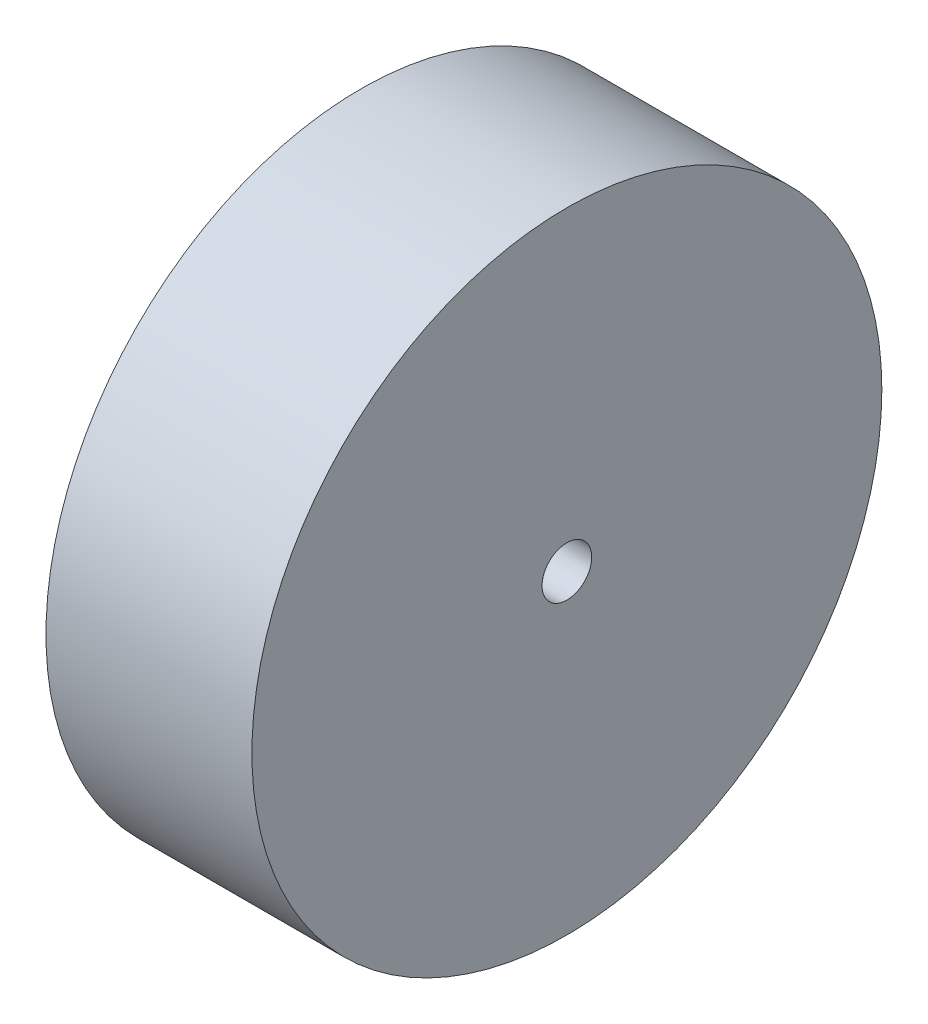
from build123d import *

# Parameters (mm, degrees)
SKETCH1_R           = 26
SKETCH1_R_2         = 2.05
BOSS_EXTRUDE1_DEPTH = 8.5


with BuildPart() as part:
    # Sketch1 → Boss-Extrude1 (new, symmetric)
    with BuildSketch(Plane(origin=(0, 0, 0), x_dir=(0, 0, -1), z_dir=(1, 0, 0))):
        Circle(SKETCH1_R)
        Circle(SKETCH1_R_2, mode=Mode.SUBTRACT)
    extrude(amount=BOSS_EXTRUDE1_DEPTH, both=True)


solid = part.part
